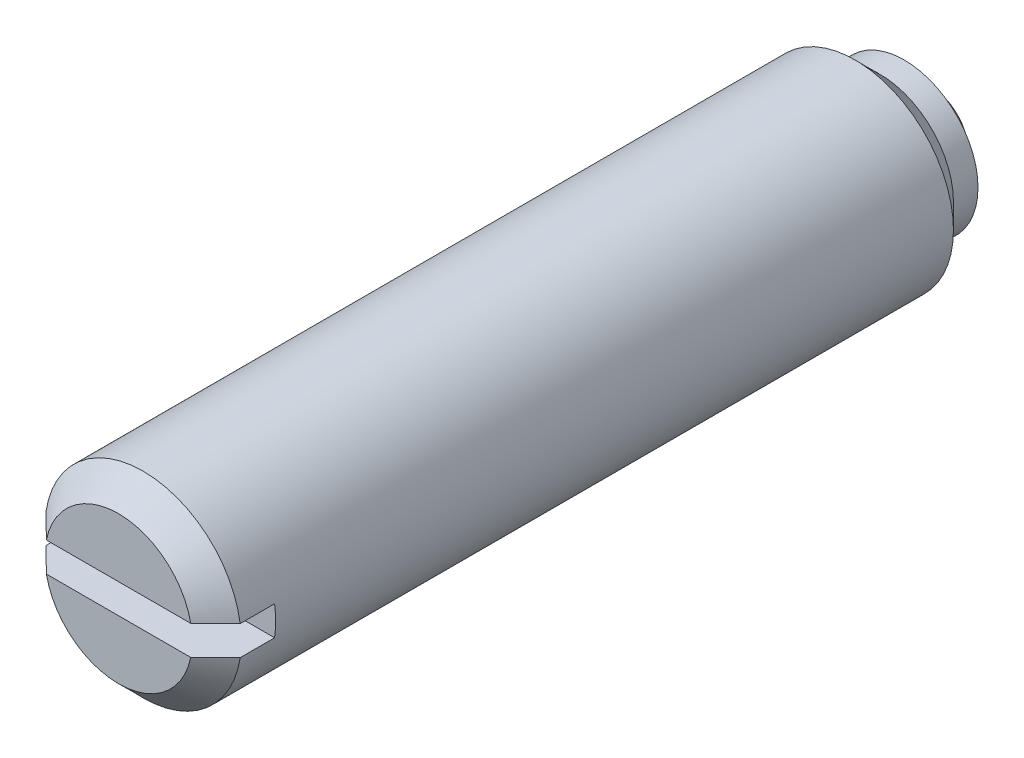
ISO-10303-21;
HEADER;
FILE_DESCRIPTION(('STEP AP214'),'2;1');
FILE_NAME('part.step','',(''),(''),'','','');
FILE_SCHEMA(('AUTOMOTIVE_DESIGN { 1 0 10303 214 1 1 1 1 }'));
ENDSEC;
DATA;
#1=APPLICATION_CONTEXT('core data for automotive mechanical design processes');
#2=APPLICATION_PROTOCOL_DEFINITION('international standard','automotive_design',2000,#1);
#3=PRODUCT_CONTEXT('',#1,'mechanical');
#4=PRODUCT('Part','Part','',(#3));
#5=PRODUCT_RELATED_PRODUCT_CATEGORY('part','',(#4));
#6=PRODUCT_DEFINITION_FORMATION('','',#4);
#7=PRODUCT_DEFINITION_CONTEXT('part definition',#1,'design');
#8=PRODUCT_DEFINITION('design','',#6,#7);
#9=PRODUCT_DEFINITION_SHAPE('','',#8);
#10=(LENGTH_UNIT() NAMED_UNIT(*) SI_UNIT(.MILLI.,.METRE.));
#11=(NAMED_UNIT(*) PLANE_ANGLE_UNIT() SI_UNIT($,.RADIAN.));
#12=(NAMED_UNIT(*) SI_UNIT($,.STERADIAN.) SOLID_ANGLE_UNIT());
#13=UNCERTAINTY_MEASURE_WITH_UNIT(LENGTH_MEASURE(1.E-05),#10,'distance_accuracy_value','');
#14=(GEOMETRIC_REPRESENTATION_CONTEXT(3) GLOBAL_UNCERTAINTY_ASSIGNED_CONTEXT((#13)) GLOBAL_UNIT_ASSIGNED_CONTEXT((#10,
#11,#12)) REPRESENTATION_CONTEXT('',''));
#15=CARTESIAN_POINT('',(0.,0.,0.));
#16=DIRECTION('',(0.,0.,1.));
#17=DIRECTION('',(1.,0.,0.));
#18=AXIS2_PLACEMENT_3D('',#15,#16,#17);
#19=CARTESIAN_POINT('',(0.,0.,0.8));
#20=DIRECTION('',(0.,0.,-1.));
#21=DIRECTION('',(-1.,0.,0.));
#22=AXIS2_PLACEMENT_3D('',#19,#20,#21);
#23=PLANE('',#22);
#24=CARTESIAN_POINT('',(0.,0.,0.8));
#25=DIRECTION('',(0.,0.,-1.));
#26=DIRECTION('',(-1.,0.,0.));
#27=AXIS2_PLACEMENT_3D('',#24,#25,#26);
#28=CIRCLE('',#27,1.16619037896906);
#29=CARTESIAN_POINT('',(-1.16619037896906,0.,0.8));
#30=VERTEX_POINT('',#29);
#31=EDGE_CURVE('E151',#30,#30,#28,.T.);
#32=ORIENTED_EDGE('',*,*,#31,.F.);
#33=EDGE_LOOP('',(#32));
#34=FACE_BOUND('',#33,.T.);
#35=CARTESIAN_POINT('',(0.,0.,0.8));
#36=DIRECTION('',(0.,0.,1.));
#37=DIRECTION('',(1.,0.,0.));
#38=AXIS2_PLACEMENT_3D('',#35,#36,#37);
#39=CIRCLE('',#38,1.5);
#40=CARTESIAN_POINT('',(1.5,0.,0.8));
#41=VERTEX_POINT('',#40);
#42=EDGE_CURVE('E158',#41,#41,#39,.T.);
#43=ORIENTED_EDGE('',*,*,#42,.F.);
#44=EDGE_LOOP('',(#43));
#45=FACE_BOUND('',#44,.T.);
#46=ADVANCED_FACE('F14',(#34,#45),#23,.T.);
#47=CARTESIAN_POINT('',(0.,0.,1.25));
#48=DIRECTION('',(0.,0.,-1.));
#49=DIRECTION('',(1.,0.,0.));
#50=AXIS2_PLACEMENT_3D('',#47,#48,#49);
#51=SPHERICAL_SURFACE('',#50,1.25);
#52=ORIENTED_EDGE('',*,*,#31,.T.);
#53=EDGE_LOOP('',(#52));
#54=FACE_BOUND('',#53,.T.);
#55=ADVANCED_FACE('F178',(#54),#51,.T.);
#56=CARTESIAN_POINT('',(0.,0.,18.1618857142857));
#57=DIRECTION('',(0.,0.,1.));
#58=DIRECTION('',(1.,0.,0.));
#59=AXIS2_PLACEMENT_3D('',#56,#57,#58);
#60=CYLINDRICAL_SURFACE('',#59,1.5);
#61=ORIENTED_EDGE('',*,*,#42,.T.);
#62=EDGE_LOOP('',(#61));
#63=FACE_BOUND('',#62,.T.);
#64=CARTESIAN_POINT('',(0.,0.,1.3));
#65=DIRECTION('',(0.,0.,1.));
#66=DIRECTION('',(1.,0.,0.));
#67=AXIS2_PLACEMENT_3D('',#64,#65,#66);
#68=CIRCLE('',#67,1.5);
#69=CARTESIAN_POINT('',(1.5,0.,1.3));
#70=VERTEX_POINT('',#69);
#71=EDGE_CURVE('E161',#70,#70,#68,.T.);
#72=ORIENTED_EDGE('',*,*,#71,.F.);
#73=EDGE_LOOP('',(#72));
#74=FACE_BOUND('',#73,.T.);
#75=ADVANCED_FACE('F170',(#63,#74),#60,.T.);
#76=CARTESIAN_POINT('',(0.,0.,1.8));
#77=DIRECTION('',(0.,0.,1.));
#78=DIRECTION('',(1.,0.,0.));
#79=AXIS2_PLACEMENT_3D('',#76,#77,#78);
#80=CONICAL_SURFACE('',#79,2.,0.785398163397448);
#81=ORIENTED_EDGE('',*,*,#71,.T.);
#82=EDGE_LOOP('',(#81));
#83=FACE_BOUND('',#82,.T.);
#84=CARTESIAN_POINT('',(0.,0.,1.8));
#85=DIRECTION('',(0.,0.,1.));
#86=DIRECTION('',(1.,0.,0.));
#87=AXIS2_PLACEMENT_3D('',#84,#85,#86);
#88=CIRCLE('',#87,2.);
#89=CARTESIAN_POINT('',(2.,0.,1.8));
#90=VERTEX_POINT('',#89);
#91=EDGE_CURVE('E164',#90,#90,#88,.T.);
#92=ORIENTED_EDGE('',*,*,#91,.F.);
#93=EDGE_LOOP('',(#92));
#94=FACE_BOUND('',#93,.T.);
#95=ADVANCED_FACE('F168',(#83,#94),#80,.T.);
#96=CARTESIAN_POINT('',(0.,2.,16.8));
#97=DIRECTION('',(0.,0.,1.));
#98=DIRECTION('',(1.,0.,0.));
#99=AXIS2_PLACEMENT_3D('',#96,#97,#98);
#100=PLANE('',#99);
#101=DIRECTION('',(1.,0.,0.));
#102=VECTOR('',#101,1.);
#103=CARTESIAN_POINT('',(-1.97737199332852,-0.3,16.8));
#104=LINE('',#103,#102);
#105=CARTESIAN_POINT('',(-1.4696938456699,-0.3,16.8));
#106=VERTEX_POINT('',#105);
#107=CARTESIAN_POINT('',(1.4696938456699,-0.3,16.8));
#108=VERTEX_POINT('',#107);
#109=EDGE_CURVE('E148',#106,#108,#104,.T.);
#110=ORIENTED_EDGE('',*,*,#109,.F.);
#111=CARTESIAN_POINT('',(0.,0.,16.8));
#112=DIRECTION('',(0.,0.,1.));
#113=DIRECTION('',(1.,0.,0.));
#114=AXIS2_PLACEMENT_3D('',#111,#112,#113);
#115=CIRCLE('',#114,1.5);
#116=EDGE_CURVE('E142',#106,#108,#115,.T.);
#117=ORIENTED_EDGE('',*,*,#116,.T.);
#118=EDGE_LOOP('',(#110,#117));
#119=FACE_BOUND('',#118,.T.);
#120=ADVANCED_FACE('F124',(#119),#100,.T.);
#121=CARTESIAN_POINT('',(-1.97737199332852,-0.3,15.6));
#122=DIRECTION('',(0.,-1.,0.));
#123=DIRECTION('',(1.,0.,0.));
#124=AXIS2_PLACEMENT_3D('',#121,#122,#123);
#125=PLANE('',#124);
#126=DIRECTION('',(0.,0.,1.));
#127=VECTOR('',#126,1.);
#128=CARTESIAN_POINT('',(-1.97737199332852,-0.3,15.6));
#129=LINE('',#128,#127);
#130=CARTESIAN_POINT('',(-1.97737199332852,-0.3,15.6));
#131=VERTEX_POINT('',#130);
#132=CARTESIAN_POINT('',(-1.97737199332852,-0.3,16.3));
#133=VERTEX_POINT('',#132);
#134=EDGE_CURVE('E81',#131,#133,#129,.T.);
#135=ORIENTED_EDGE('',*,*,#134,.T.);
#136=CARTESIAN_POINT('',(-1.97737199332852,-0.3,16.3));
#137=CARTESIAN_POINT('',(-1.89291452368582,-0.3,16.3834909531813));
#138=CARTESIAN_POINT('',(-1.80840793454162,-0.3,16.4669324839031));
#139=CARTESIAN_POINT('',(-1.68150992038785,-0.3,16.5919544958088));
#140=CARTESIAN_POINT('',(-1.63918756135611,-0.3,16.6336051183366));
#141=CARTESIAN_POINT('',(-1.55448600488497,-0.3,16.7168486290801));
#142=CARTESIAN_POINT('',(-1.51210680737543,-0.3,16.7584415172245));
#143=CARTESIAN_POINT('',(-1.4696938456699,-0.3,16.8));
#144=B_SPLINE_CURVE_WITH_KNOTS('',3,(#136,#137,#138,#139,#140,#141,#142,#143),.UNSPECIFIED.,.F.,
.F.,(4,2,2,4),(0.,0.356278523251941,0.534417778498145,0.712557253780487),.UNSPECIFIED.);
#145=EDGE_CURVE('E110',#133,#106,#144,.T.);
#146=ORIENTED_EDGE('',*,*,#145,.T.);
#147=ORIENTED_EDGE('',*,*,#109,.T.);
#148=CARTESIAN_POINT('',(1.4696938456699,-0.3,16.8));
#149=CARTESIAN_POINT('',(1.51210680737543,-0.3,16.7584415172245));
#150=CARTESIAN_POINT('',(1.55448600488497,-0.3,16.7168486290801));
#151=CARTESIAN_POINT('',(1.63918756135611,-0.3,16.6336051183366));
#152=CARTESIAN_POINT('',(1.68150992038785,-0.3,16.5919544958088));
#153=CARTESIAN_POINT('',(1.80840793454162,-0.3,16.4669324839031));
#154=CARTESIAN_POINT('',(1.89291452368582,-0.3,16.3834909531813));
#155=CARTESIAN_POINT('',(1.97737199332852,-0.3,16.3));
#156=B_SPLINE_CURVE_WITH_KNOTS('',3,(#148,#149,#150,#151,#152,#153,#154,#155),.UNSPECIFIED.,.F.,
.F.,(4,2,2,4),(0.,0.178139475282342,0.356278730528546,0.712557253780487),.UNSPECIFIED.);
#157=CARTESIAN_POINT('',(1.97737199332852,-0.3,16.3));
#158=VERTEX_POINT('',#157);
#159=EDGE_CURVE('E103',#108,#158,#156,.T.);
#160=ORIENTED_EDGE('',*,*,#159,.T.);
#161=DIRECTION('',(0.,0.,1.));
#162=VECTOR('',#161,1.);
#163=CARTESIAN_POINT('',(1.97737199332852,-0.3,15.6));
#164=LINE('',#163,#162);
#165=CARTESIAN_POINT('',(1.97737199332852,-0.3,15.6));
#166=VERTEX_POINT('',#165);
#167=EDGE_CURVE('E83',#166,#158,#164,.T.);
#168=ORIENTED_EDGE('',*,*,#167,.F.);
#169=DIRECTION('',(1.,0.,0.));
#170=VECTOR('',#169,1.);
#171=CARTESIAN_POINT('',(-1.97737199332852,-0.3,15.6));
#172=LINE('',#171,#170);
#173=EDGE_CURVE('E68',#131,#166,#172,.T.);
#174=ORIENTED_EDGE('',*,*,#173,.F.);
#175=EDGE_LOOP('',(#135,#146,#147,#160,#168,#174));
#176=FACE_BOUND('',#175,.T.);
#177=ADVANCED_FACE('F80',(#176),#125,.F.);
#178=DIRECTION('',(1.,0.,0.));
#179=VECTOR('',#178,1.);
#180=CARTESIAN_POINT('',(-1.97737199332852,0.3,16.8));
#181=LINE('',#180,#179);
#182=CARTESIAN_POINT('',(-1.4696938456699,0.3,16.8));
#183=VERTEX_POINT('',#182);
#184=CARTESIAN_POINT('',(1.4696938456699,0.3,16.8));
#185=VERTEX_POINT('',#184);
#186=EDGE_CURVE('E75',#183,#185,#181,.T.);
#187=ORIENTED_EDGE('',*,*,#186,.T.);
#188=CARTESIAN_POINT('',(0.,0.,16.8));
#189=DIRECTION('',(0.,0.,1.));
#190=DIRECTION('',(1.,0.,0.));
#191=AXIS2_PLACEMENT_3D('',#188,#189,#190);
#192=CIRCLE('',#191,1.5);
#193=EDGE_CURVE('E9',#185,#183,#192,.T.);
#194=ORIENTED_EDGE('',*,*,#193,.T.);
#195=EDGE_LOOP('',(#187,#194));
#196=FACE_BOUND('',#195,.T.);
#197=ADVANCED_FACE('F123',(#196),#100,.T.);
#198=CARTESIAN_POINT('',(-1.97737199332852,0.3,15.6));
#199=DIRECTION('',(0.,-1.,0.));
#200=DIRECTION('',(1.,0.,0.));
#201=AXIS2_PLACEMENT_3D('',#198,#199,#200);
#202=PLANE('',#201);
#203=DIRECTION('',(0.,0.,1.));
#204=VECTOR('',#203,1.);
#205=CARTESIAN_POINT('',(1.97737199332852,0.3,15.6));
#206=LINE('',#205,#204);
#207=CARTESIAN_POINT('',(1.97737199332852,0.3,15.6));
#208=VERTEX_POINT('',#207);
#209=CARTESIAN_POINT('',(1.97737199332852,0.3,16.3));
#210=VERTEX_POINT('',#209);
#211=EDGE_CURVE('E92',#208,#210,#206,.T.);
#212=ORIENTED_EDGE('',*,*,#211,.T.);
#213=CARTESIAN_POINT('',(1.97737199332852,0.3,16.3));
#214=CARTESIAN_POINT('',(1.89291452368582,0.3,16.3834909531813));
#215=CARTESIAN_POINT('',(1.80840793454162,0.3,16.4669324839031));
#216=CARTESIAN_POINT('',(1.68150992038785,0.3,16.5919544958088));
#217=CARTESIAN_POINT('',(1.63918756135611,0.3,16.6336051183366));
#218=CARTESIAN_POINT('',(1.55448600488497,0.3,16.7168486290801));
#219=CARTESIAN_POINT('',(1.51210680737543,0.3,16.7584415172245));
#220=CARTESIAN_POINT('',(1.4696938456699,0.3,16.8));
#221=B_SPLINE_CURVE_WITH_KNOTS('',3,(#213,#214,#215,#216,#217,#218,#219,#220),.UNSPECIFIED.,.F.,
.F.,(4,2,2,4),(0.,0.356278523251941,0.534417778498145,0.712557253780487),.UNSPECIFIED.);
#222=EDGE_CURVE('E23',#210,#185,#221,.T.);
#223=ORIENTED_EDGE('',*,*,#222,.T.);
#224=ORIENTED_EDGE('',*,*,#186,.F.);
#225=CARTESIAN_POINT('',(-1.4696938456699,0.3,16.8));
#226=CARTESIAN_POINT('',(-1.51210680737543,0.3,16.7584415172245));
#227=CARTESIAN_POINT('',(-1.55448600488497,0.3,16.7168486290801));
#228=CARTESIAN_POINT('',(-1.63918756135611,0.3,16.6336051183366));
#229=CARTESIAN_POINT('',(-1.68150992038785,0.3,16.5919544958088));
#230=CARTESIAN_POINT('',(-1.80840793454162,0.3,16.4669324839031));
#231=CARTESIAN_POINT('',(-1.89291452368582,0.3,16.3834909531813));
#232=CARTESIAN_POINT('',(-1.97737199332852,0.3,16.3));
#233=B_SPLINE_CURVE_WITH_KNOTS('',3,(#225,#226,#227,#228,#229,#230,#231,#232),.UNSPECIFIED.,.F.,
.F.,(4,2,2,4),(0.,0.178139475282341,0.356278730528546,0.712557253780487),.UNSPECIFIED.);
#234=CARTESIAN_POINT('',(-1.97737199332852,0.3,16.3));
#235=VERTEX_POINT('',#234);
#236=EDGE_CURVE('E133',#183,#235,#233,.T.);
#237=ORIENTED_EDGE('',*,*,#236,.T.);
#238=DIRECTION('',(0.,0.,1.));
#239=VECTOR('',#238,1.);
#240=CARTESIAN_POINT('',(-1.97737199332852,0.3,15.6));
#241=LINE('',#240,#239);
#242=CARTESIAN_POINT('',(-1.97737199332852,0.3,15.6));
#243=VERTEX_POINT('',#242);
#244=EDGE_CURVE('E97',#243,#235,#241,.T.);
#245=ORIENTED_EDGE('',*,*,#244,.F.);
#246=DIRECTION('',(1.,0.,0.));
#247=VECTOR('',#246,1.);
#248=CARTESIAN_POINT('',(-1.97737199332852,0.3,15.6));
#249=LINE('',#248,#247);
#250=EDGE_CURVE('E71',#243,#208,#249,.T.);
#251=ORIENTED_EDGE('',*,*,#250,.T.);
#252=EDGE_LOOP('',(#212,#223,#224,#237,#245,#251));
#253=FACE_BOUND('',#252,.T.);
#254=ADVANCED_FACE('F126',(#253),#202,.T.);
#255=CARTESIAN_POINT('',(0.,0.,15.6));
#256=DIRECTION('',(0.,0.,1.));
#257=DIRECTION('',(1.,0.,0.));
#258=AXIS2_PLACEMENT_3D('',#255,#256,#257);
#259=PLANE('',#258);
#260=CARTESIAN_POINT('',(0.,0.,15.6));
#261=DIRECTION('',(0.,0.,1.));
#262=DIRECTION('',(1.,0.,0.));
#263=AXIS2_PLACEMENT_3D('',#260,#261,#262);
#264=CIRCLE('',#263,2.);
#265=EDGE_CURVE('E65',#243,#131,#264,.T.);
#266=ORIENTED_EDGE('',*,*,#265,.T.);
#267=ORIENTED_EDGE('',*,*,#173,.T.);
#268=EDGE_CURVE('E77',#166,#208,#264,.T.);
#269=ORIENTED_EDGE('',*,*,#268,.T.);
#270=ORIENTED_EDGE('',*,*,#250,.F.);
#271=EDGE_LOOP('',(#266,#267,#269,#270));
#272=FACE_BOUND('',#271,.T.);
#273=ADVANCED_FACE('F67',(#272),#259,.T.);
#274=CARTESIAN_POINT('',(0.,0.,-3.2));
#275=DIRECTION('',(0.,0.,-1.));
#276=DIRECTION('',(-1.,0.,0.));
#277=AXIS2_PLACEMENT_3D('',#274,#275,#276);
#278=CYLINDRICAL_SURFACE('',#277,2.);
#279=ORIENTED_EDGE('',*,*,#167,.T.);
#280=CARTESIAN_POINT('',(0.,0.,16.3));
#281=DIRECTION('',(0.,0.,1.));
#282=DIRECTION('',(1.,0.,0.));
#283=AXIS2_PLACEMENT_3D('',#280,#281,#282);
#284=CIRCLE('',#283,2.);
#285=EDGE_CURVE('E90',#158,#133,#284,.F.);
#286=ORIENTED_EDGE('',*,*,#285,.T.);
#287=ORIENTED_EDGE('',*,*,#134,.F.);
#288=ORIENTED_EDGE('',*,*,#265,.F.);
#289=ORIENTED_EDGE('',*,*,#244,.T.);
#290=CARTESIAN_POINT('',(0.,0.,16.3));
#291=DIRECTION('',(0.,0.,1.));
#292=DIRECTION('',(1.,0.,0.));
#293=AXIS2_PLACEMENT_3D('',#290,#291,#292);
#294=CIRCLE('',#293,2.);
#295=EDGE_CURVE('E99',#235,#210,#294,.F.);
#296=ORIENTED_EDGE('',*,*,#295,.T.);
#297=ORIENTED_EDGE('',*,*,#211,.F.);
#298=ORIENTED_EDGE('',*,*,#268,.F.);
#299=EDGE_LOOP('',(#279,#286,#287,#288,#289,#296,#297,#298));
#300=FACE_BOUND('',#299,.T.);
#301=ORIENTED_EDGE('',*,*,#91,.T.);
#302=EDGE_LOOP('',(#301));
#303=FACE_BOUND('',#302,.T.);
#304=ADVANCED_FACE('F87',(#300,#303),#278,.T.);
#305=CARTESIAN_POINT('',(0.,0.,16.3));
#306=DIRECTION('',(0.,0.,-1.));
#307=DIRECTION('',(-1.,0.,0.));
#308=AXIS2_PLACEMENT_3D('',#305,#306,#307);
#309=CONICAL_SURFACE('',#308,2.,0.785398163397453);
#310=ORIENTED_EDGE('',*,*,#159,.F.);
#311=ORIENTED_EDGE('',*,*,#116,.F.);
#312=ORIENTED_EDGE('',*,*,#145,.F.);
#313=ORIENTED_EDGE('',*,*,#285,.F.);
#314=EDGE_LOOP('',(#310,#311,#312,#313));
#315=FACE_BOUND('',#314,.T.);
#316=ADVANCED_FACE('F116',(#315),#309,.T.);
#317=CARTESIAN_POINT('',(0.,0.,16.3));
#318=DIRECTION('',(0.,0.,-1.));
#319=DIRECTION('',(-1.,0.,0.));
#320=AXIS2_PLACEMENT_3D('',#317,#318,#319);
#321=CONICAL_SURFACE('',#320,2.,0.785398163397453);
#322=ORIENTED_EDGE('',*,*,#236,.F.);
#323=ORIENTED_EDGE('',*,*,#193,.F.);
#324=ORIENTED_EDGE('',*,*,#222,.F.);
#325=ORIENTED_EDGE('',*,*,#295,.F.);
#326=EDGE_LOOP('',(#322,#323,#324,#325));
#327=FACE_BOUND('',#326,.T.);
#328=ADVANCED_FACE('F16',(#327),#321,.T.);
#329=CLOSED_SHELL('',(#46,#55,#75,#95,#120,#177,#197,#254,#273,#304,#316,#328));
#330=MANIFOLD_SOLID_BREP('B1',#329);
#331=ADVANCED_BREP_SHAPE_REPRESENTATION('',(#18,#330),#14);
#332=SHAPE_DEFINITION_REPRESENTATION(#9,#331);
ENDSEC;
END-ISO-10303-21;
